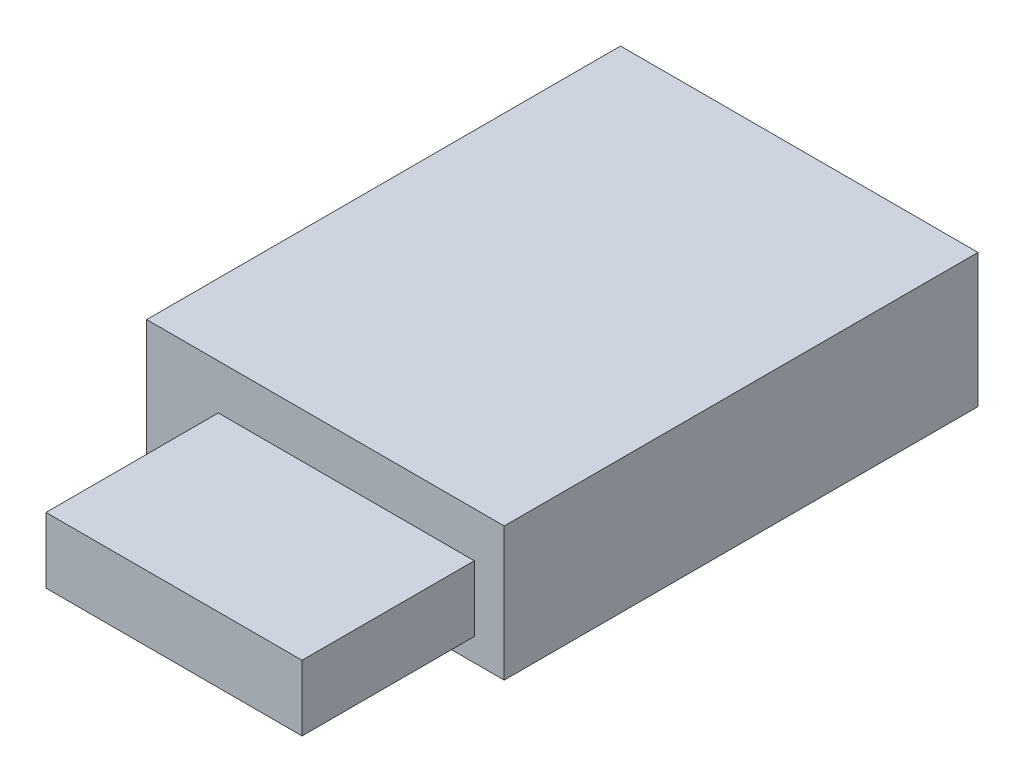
from build123d import *

# Parameters (mm, degrees)
SKETCH1_W      = 105.41
SKETCH1_H      = 139.7
EXTRUDE1_DEPTH = 39.37
SKETCH2_W      = 75.491476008
SKETCH2_H      = 19.337015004
EXTRUDE2_DEPTH = 50.8


with BuildPart() as part:
    # Sketch1 → Extrude1 (new body)
    with BuildSketch(Plane(origin=(0, 0, 0), x_dir=(1, 0, 0), z_dir=(0, 1, 0))):
        with Locations((13.277175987, 21.479782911)):
            Rectangle(SKETCH1_W, SKETCH1_H)
    extrude(amount=EXTRUDE1_DEPTH)

    # Sketch2 → Extrude2 (add)
    with BuildSketch(Plane.XY.offset(48.370217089)):
        with Locations((19.421417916, 16.405568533)):
            Rectangle(SKETCH2_W, SKETCH2_H)
    extrude(amount=EXTRUDE2_DEPTH)


solid = part.part
